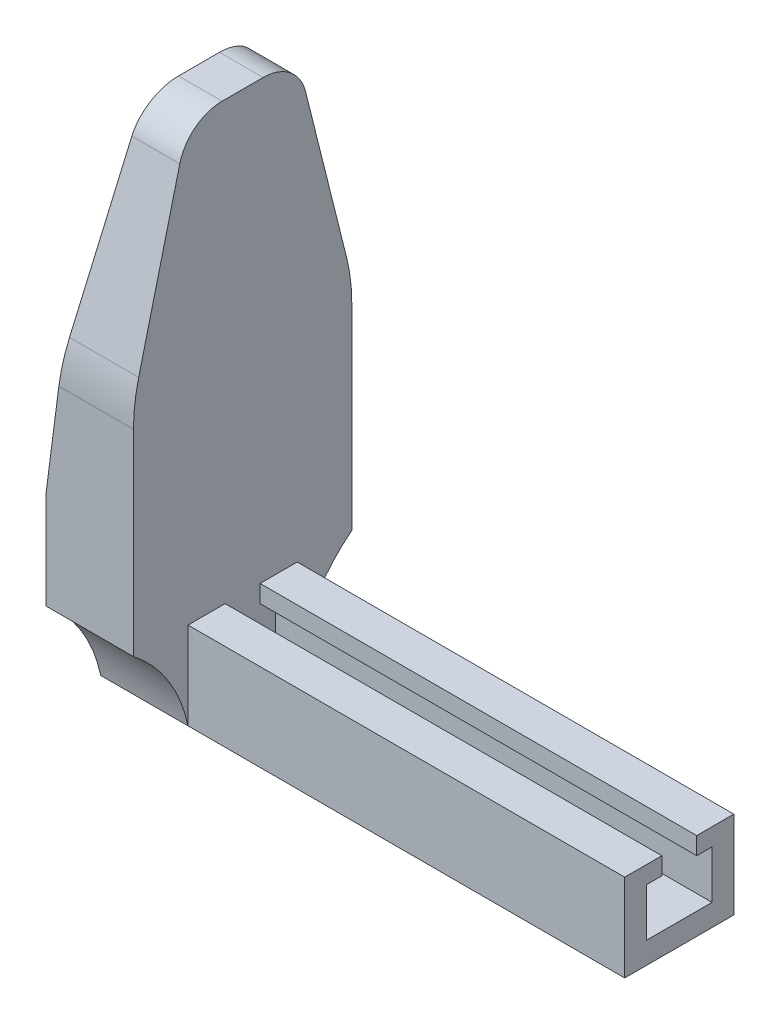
from build123d import *

# Parameters (mm, degrees)
BOSS_EXTRUDE1_DEPTH     = 100
BOSS_EXTRUDE2_DEPTH     = 20
CUT_EXTRUDE1_DEPTH      = 151.748134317
CUT_EXTRUDE1_DEPTH_BACK = 151.748134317


with BuildPart() as part:
    # Sketch1 → Boss-Extrude1 (new body)
    with BuildSketch(Plane(origin=(0, 0, 0), x_dir=(0, 0, -1), z_dir=(1, 0, 0))):
        Polygon((4, 10), (12.5, 10), (12.5, -10), (-12.5, -10), (-12.5, 10), (-4, 10), (-4, 6), (-7.5, 6), (-7.5, -5), (7.5, -5), (7.5, 6), (4, 6), align=None)
    extrude(amount=BOSS_EXTRUDE1_DEPTH)

    # Sketch2 → Boss-Extrude2 (add)
    with BuildSketch(Plane(origin=(0, 0, 0), x_dir=(0, 0, -1), z_dir=(1, 0, 0))):
        with BuildLine():
            Line((-12.5, -10), (12.5, -10))
            ThreePointArc((12.5, -10), (16.974744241, 1.109534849), (25, 10))
            Line((25, 10), (25, 55.075774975))
            ThreePointArc((25, 55.075774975), (24.700302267, 59.963105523), (23.805700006, 64.777199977))
            Line((23.805700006, 64.777199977), (14.393660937, 102.42535625))
            ThreePointArc((14.393660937, 102.42535625), (10.84635803, 107.88205438), (4.692235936, 110))
            Line((4.692235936, 110), (-4.692235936, 110))
            ThreePointArc((-4.692235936, 110), (-10.84635803, 107.88205438), (-14.393660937, 102.42535625))
            Line((-14.393660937, 102.42535625), (-23.805700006, 64.777199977))
            ThreePointArc((-23.805700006, 64.777199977), (-24.700302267, 59.963105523), (-25, 55.075774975))
            Line((-25, 55.075774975), (-25, 10))
            ThreePointArc((-25, 10), (-16.974744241, 1.109534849), (-12.5, -10))
        make_face()
    extrude(amount=-BOSS_EXTRUDE2_DEPTH)

    # Sketch3 → Cut-Extrude1 (cut, two sides: drawn at the far end of the back side and taken through both)
    with BuildSketch(Plane.XY.offset(-CUT_EXTRUDE1_DEPTH_BACK)):
        Polygon((-10, 110), (-20, 32.537887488), (-20, 110), align=None)
    extrude(amount=CUT_EXTRUDE1_DEPTH + CUT_EXTRUDE1_DEPTH_BACK, mode=Mode.SUBTRACT)


solid = part.part
